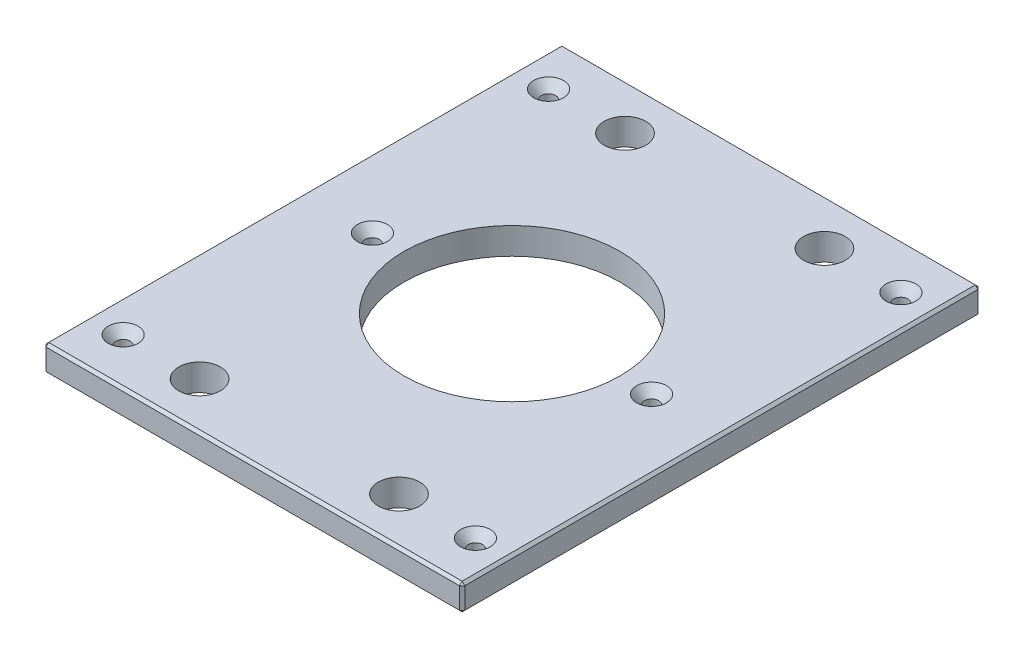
ISO-10303-21;
HEADER;
FILE_DESCRIPTION(('STEP AP214'),'2;1');
FILE_NAME('part.step','',(''),(''),'','','');
FILE_SCHEMA(('AUTOMOTIVE_DESIGN { 1 0 10303 214 1 1 1 1 }'));
ENDSEC;
DATA;
#1=APPLICATION_CONTEXT('core data for automotive mechanical design processes');
#2=APPLICATION_PROTOCOL_DEFINITION('international standard','automotive_design',2000,#1);
#3=PRODUCT_CONTEXT('',#1,'mechanical');
#4=PRODUCT('Part','Part','',(#3));
#5=PRODUCT_RELATED_PRODUCT_CATEGORY('part','',(#4));
#6=PRODUCT_DEFINITION_FORMATION('','',#4);
#7=PRODUCT_DEFINITION_CONTEXT('part definition',#1,'design');
#8=PRODUCT_DEFINITION('design','',#6,#7);
#9=PRODUCT_DEFINITION_SHAPE('','',#8);
#10=(LENGTH_UNIT() NAMED_UNIT(*) SI_UNIT(.MILLI.,.METRE.));
#11=(NAMED_UNIT(*) PLANE_ANGLE_UNIT() SI_UNIT($,.RADIAN.));
#12=(NAMED_UNIT(*) SI_UNIT($,.STERADIAN.) SOLID_ANGLE_UNIT());
#13=UNCERTAINTY_MEASURE_WITH_UNIT(LENGTH_MEASURE(1.E-05),#10,'distance_accuracy_value','');
#14=(GEOMETRIC_REPRESENTATION_CONTEXT(3) GLOBAL_UNCERTAINTY_ASSIGNED_CONTEXT((#13)) GLOBAL_UNIT_ASSIGNED_CONTEXT((#10,
#11,#12)) REPRESENTATION_CONTEXT('',''));
#15=CARTESIAN_POINT('',(0.,0.,0.));
#16=DIRECTION('',(0.,0.,1.));
#17=DIRECTION('',(1.,0.,0.));
#18=AXIS2_PLACEMENT_3D('',#15,#16,#17);
#19=CARTESIAN_POINT('',(-100.0125,12.7,-123.825));
#20=DIRECTION('',(1.,0.,0.));
#21=DIRECTION('',(0.,0.,-1.));
#22=AXIS2_PLACEMENT_3D('',#19,#20,#21);
#23=PLANE('',#22);
#24=DIRECTION('',(0.,0.,-1.));
#25=VECTOR('',#24,1.);
#26=CARTESIAN_POINT('',(-100.0125,11.43,-123.825));
#27=LINE('',#26,#25);
#28=CARTESIAN_POINT('',(-100.0125,11.43,122.555));
#29=VERTEX_POINT('',#28);
#30=CARTESIAN_POINT('',(-100.0125,11.43,-122.555));
#31=VERTEX_POINT('',#30);
#32=EDGE_CURVE('E135',#29,#31,#27,.T.);
#33=ORIENTED_EDGE('',*,*,#32,.T.);
#34=DIRECTION('',(0.,-1.,0.));
#35=VECTOR('',#34,1.);
#36=CARTESIAN_POINT('',(-100.0125,12.7,-122.555));
#37=LINE('',#36,#35);
#38=CARTESIAN_POINT('',(-100.0125,1.26999999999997,-122.555));
#39=VERTEX_POINT('',#38);
#40=EDGE_CURVE('E131',#31,#39,#37,.T.);
#41=ORIENTED_EDGE('',*,*,#40,.T.);
#42=DIRECTION('',(0.,0.,1.));
#43=VECTOR('',#42,1.);
#44=CARTESIAN_POINT('',(-100.0125,1.26999999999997,-123.825));
#45=LINE('',#44,#43);
#46=CARTESIAN_POINT('',(-100.0125,1.26999999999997,122.555));
#47=VERTEX_POINT('',#46);
#48=EDGE_CURVE('E126',#39,#47,#45,.T.);
#49=ORIENTED_EDGE('',*,*,#48,.T.);
#50=DIRECTION('',(0.,1.,0.));
#51=VECTOR('',#50,1.);
#52=CARTESIAN_POINT('',(-100.0125,12.7,122.555));
#53=LINE('',#52,#51);
#54=EDGE_CURVE('E128',#47,#29,#53,.T.);
#55=ORIENTED_EDGE('',*,*,#54,.T.);
#56=EDGE_LOOP('',(#33,#41,#49,#55));
#57=FACE_BOUND('',#56,.T.);
#58=ADVANCED_FACE('F35',(#57),#23,.F.);
#59=CARTESIAN_POINT('',(-100.0125,12.7,123.825));
#60=DIRECTION('',(0.,0.,-1.));
#61=DIRECTION('',(-1.,0.,0.));
#62=AXIS2_PLACEMENT_3D('',#59,#60,#61);
#63=PLANE('',#62);
#64=DIRECTION('',(1.,0.,0.));
#65=VECTOR('',#64,1.);
#66=CARTESIAN_POINT('',(-100.0125,1.26999999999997,123.825));
#67=LINE('',#66,#65);
#68=CARTESIAN_POINT('',(-98.7425000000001,1.26999999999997,123.825));
#69=VERTEX_POINT('',#68);
#70=CARTESIAN_POINT('',(98.7425000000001,1.26999999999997,123.825));
#71=VERTEX_POINT('',#70);
#72=EDGE_CURVE('E58',#69,#71,#67,.T.);
#73=ORIENTED_EDGE('',*,*,#72,.T.);
#74=DIRECTION('',(0.,1.,0.));
#75=VECTOR('',#74,1.);
#76=CARTESIAN_POINT('',(98.7425000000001,12.7,123.825));
#77=LINE('',#76,#75);
#78=CARTESIAN_POINT('',(98.7425000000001,11.43,123.825));
#79=VERTEX_POINT('',#78);
#80=EDGE_CURVE('E11',#71,#79,#77,.T.);
#81=ORIENTED_EDGE('',*,*,#80,.T.);
#82=DIRECTION('',(-1.,0.,0.));
#83=VECTOR('',#82,1.);
#84=CARTESIAN_POINT('',(-100.0125,11.43,123.825));
#85=LINE('',#84,#83);
#86=CARTESIAN_POINT('',(-98.7425000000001,11.43,123.825));
#87=VERTEX_POINT('',#86);
#88=EDGE_CURVE('E44',#79,#87,#85,.T.);
#89=ORIENTED_EDGE('',*,*,#88,.T.);
#90=DIRECTION('',(0.,-1.,0.));
#91=VECTOR('',#90,1.);
#92=CARTESIAN_POINT('',(-98.7425000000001,12.7,123.825));
#93=LINE('',#92,#91);
#94=EDGE_CURVE('E279',#87,#69,#93,.T.);
#95=ORIENTED_EDGE('',*,*,#94,.T.);
#96=EDGE_LOOP('',(#73,#81,#89,#95));
#97=FACE_BOUND('',#96,.T.);
#98=ADVANCED_FACE('F348',(#97),#63,.F.);
#99=CARTESIAN_POINT('',(100.0125,12.7,-123.825));
#100=DIRECTION('',(-1.,0.,0.));
#101=DIRECTION('',(0.,0.,1.));
#102=AXIS2_PLACEMENT_3D('',#99,#100,#101);
#103=PLANE('',#102);
#104=DIRECTION('',(0.,0.,-1.));
#105=VECTOR('',#104,1.);
#106=CARTESIAN_POINT('',(100.0125,1.26999999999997,-123.825));
#107=LINE('',#106,#105);
#108=CARTESIAN_POINT('',(100.0125,1.26999999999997,122.555));
#109=VERTEX_POINT('',#108);
#110=CARTESIAN_POINT('',(100.0125,1.26999999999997,-122.555));
#111=VERTEX_POINT('',#110);
#112=EDGE_CURVE('E274',#109,#111,#107,.T.);
#113=ORIENTED_EDGE('',*,*,#112,.T.);
#114=DIRECTION('',(0.,1.,0.));
#115=VECTOR('',#114,1.);
#116=CARTESIAN_POINT('',(100.0125,12.7,-122.555));
#117=LINE('',#116,#115);
#118=CARTESIAN_POINT('',(100.0125,11.43,-122.555));
#119=VERTEX_POINT('',#118);
#120=EDGE_CURVE('E276',#111,#119,#117,.T.);
#121=ORIENTED_EDGE('',*,*,#120,.T.);
#122=DIRECTION('',(0.,0.,1.));
#123=VECTOR('',#122,1.);
#124=CARTESIAN_POINT('',(100.0125,11.43,123.825));
#125=LINE('',#124,#123);
#126=CARTESIAN_POINT('',(100.0125,11.43,122.555));
#127=VERTEX_POINT('',#126);
#128=EDGE_CURVE('E272',#119,#127,#125,.T.);
#129=ORIENTED_EDGE('',*,*,#128,.T.);
#130=DIRECTION('',(0.,-1.,0.));
#131=VECTOR('',#130,1.);
#132=CARTESIAN_POINT('',(100.0125,12.7,122.555));
#133=LINE('',#132,#131);
#134=EDGE_CURVE('E270',#127,#109,#133,.T.);
#135=ORIENTED_EDGE('',*,*,#134,.T.);
#136=EDGE_LOOP('',(#113,#121,#129,#135));
#137=FACE_BOUND('',#136,.T.);
#138=ADVANCED_FACE('F335',(#137),#103,.F.);
#139=CARTESIAN_POINT('',(-100.0125,12.7,-123.825));
#140=DIRECTION('',(0.,0.,1.));
#141=DIRECTION('',(1.,0.,0.));
#142=AXIS2_PLACEMENT_3D('',#139,#140,#141);
#143=PLANE('',#142);
#144=DIRECTION('',(-1.,0.,0.));
#145=VECTOR('',#144,1.);
#146=CARTESIAN_POINT('',(-100.0125,1.26999999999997,-123.825));
#147=LINE('',#146,#145);
#148=CARTESIAN_POINT('',(98.7425000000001,1.26999999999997,-123.825));
#149=VERTEX_POINT('',#148);
#150=CARTESIAN_POINT('',(-98.7425000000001,1.26999999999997,-123.825));
#151=VERTEX_POINT('',#150);
#152=EDGE_CURVE('E246',#149,#151,#147,.T.);
#153=ORIENTED_EDGE('',*,*,#152,.T.);
#154=DIRECTION('',(0.,1.,0.));
#155=VECTOR('',#154,1.);
#156=CARTESIAN_POINT('',(-98.7425000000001,12.7,-123.825));
#157=LINE('',#156,#155);
#158=CARTESIAN_POINT('',(-98.7425000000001,11.43,-123.825));
#159=VERTEX_POINT('',#158);
#160=EDGE_CURVE('E250',#151,#159,#157,.T.);
#161=ORIENTED_EDGE('',*,*,#160,.T.);
#162=DIRECTION('',(1.,0.,0.));
#163=VECTOR('',#162,1.);
#164=CARTESIAN_POINT('',(100.0125,11.43,-123.825));
#165=LINE('',#164,#163);
#166=CARTESIAN_POINT('',(98.7425000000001,11.43,-123.825));
#167=VERTEX_POINT('',#166);
#168=EDGE_CURVE('E248',#159,#167,#165,.T.);
#169=ORIENTED_EDGE('',*,*,#168,.T.);
#170=DIRECTION('',(0.,-1.,0.));
#171=VECTOR('',#170,1.);
#172=CARTESIAN_POINT('',(98.7425000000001,12.7,-123.825));
#173=LINE('',#172,#171);
#174=EDGE_CURVE('E244',#167,#149,#173,.T.);
#175=ORIENTED_EDGE('',*,*,#174,.T.);
#176=EDGE_LOOP('',(#153,#161,#169,#175));
#177=FACE_BOUND('',#176,.T.);
#178=ADVANCED_FACE('F309',(#177),#143,.F.);
#179=CARTESIAN_POINT('',(0.,12.7,0.));
#180=DIRECTION('',(0.,1.,0.));
#181=DIRECTION('',(0.,0.,1.));
#182=AXIS2_PLACEMENT_3D('',#179,#180,#181);
#183=PLANE('',#182);
#184=CARTESIAN_POINT('',(84.1375,12.7,-101.6));
#185=DIRECTION('',(0.,1.,0.));
#186=DIRECTION('',(0.,0.,1.));
#187=AXIS2_PLACEMENT_3D('',#184,#185,#186);
#188=CIRCLE('',#187,7.1374);
#189=CARTESIAN_POINT('',(84.1375,12.7,-94.4626));
#190=VERTEX_POINT('',#189);
#191=EDGE_CURVE('E752',#190,#190,#188,.T.);
#192=ORIENTED_EDGE('',*,*,#191,.F.);
#193=EDGE_LOOP('',(#192));
#194=FACE_BOUND('',#193,.T.);
#195=CARTESIAN_POINT('',(84.1375,12.7,101.6));
#196=DIRECTION('',(0.,1.,0.));
#197=DIRECTION('',(0.,0.,1.));
#198=AXIS2_PLACEMENT_3D('',#195,#196,#197);
#199=CIRCLE('',#198,7.1374);
#200=CARTESIAN_POINT('',(84.1375,12.7,108.7374));
#201=VERTEX_POINT('',#200);
#202=EDGE_CURVE('E756',#201,#201,#199,.T.);
#203=ORIENTED_EDGE('',*,*,#202,.F.);
#204=EDGE_LOOP('',(#203));
#205=FACE_BOUND('',#204,.T.);
#206=CARTESIAN_POINT('',(-84.1375,12.7,101.6));
#207=DIRECTION('',(0.,1.,0.));
#208=DIRECTION('',(0.,0.,1.));
#209=AXIS2_PLACEMENT_3D('',#206,#207,#208);
#210=CIRCLE('',#209,7.1374);
#211=CARTESIAN_POINT('',(-84.1375,12.7,108.7374));
#212=VERTEX_POINT('',#211);
#213=EDGE_CURVE('E760',#212,#212,#210,.T.);
#214=ORIENTED_EDGE('',*,*,#213,.F.);
#215=EDGE_LOOP('',(#214));
#216=FACE_BOUND('',#215,.T.);
#217=CARTESIAN_POINT('',(-66.675,12.7,0.));
#218=DIRECTION('',(0.,1.,0.));
#219=DIRECTION('',(0.,0.,1.));
#220=AXIS2_PLACEMENT_3D('',#217,#218,#219);
#221=CIRCLE('',#220,7.1374);
#222=CARTESIAN_POINT('',(-66.675,12.7,7.1374));
#223=VERTEX_POINT('',#222);
#224=EDGE_CURVE('E764',#223,#223,#221,.T.);
#225=ORIENTED_EDGE('',*,*,#224,.F.);
#226=EDGE_LOOP('',(#225));
#227=FACE_BOUND('',#226,.T.);
#228=CARTESIAN_POINT('',(66.675,12.7,0.));
#229=DIRECTION('',(0.,1.,0.));
#230=DIRECTION('',(0.,0.,1.));
#231=AXIS2_PLACEMENT_3D('',#228,#229,#230);
#232=CIRCLE('',#231,7.1374);
#233=CARTESIAN_POINT('',(66.675,12.7,7.1374));
#234=VERTEX_POINT('',#233);
#235=EDGE_CURVE('E768',#234,#234,#232,.T.);
#236=ORIENTED_EDGE('',*,*,#235,.F.);
#237=EDGE_LOOP('',(#236));
#238=FACE_BOUND('',#237,.T.);
#239=CARTESIAN_POINT('',(-84.1375,12.7,-101.6));
#240=DIRECTION('',(0.,1.,0.));
#241=DIRECTION('',(0.,0.,1.));
#242=AXIS2_PLACEMENT_3D('',#239,#240,#241);
#243=CIRCLE('',#242,7.1374);
#244=CARTESIAN_POINT('',(-84.1375,12.7,-94.4626));
#245=VERTEX_POINT('',#244);
#246=EDGE_CURVE('E771',#245,#245,#243,.T.);
#247=ORIENTED_EDGE('',*,*,#246,.F.);
#248=EDGE_LOOP('',(#247));
#249=FACE_BOUND('',#248,.T.);
#250=DIRECTION('',(0.,0.,-1.));
#251=VECTOR('',#250,1.);
#252=CARTESIAN_POINT('',(98.7425000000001,12.7,-123.825));
#253=LINE('',#252,#251);
#254=CARTESIAN_POINT('',(98.7425000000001,12.7,122.555));
#255=VERTEX_POINT('',#254);
#256=CARTESIAN_POINT('',(98.7425000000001,12.7,-122.555));
#257=VERTEX_POINT('',#256);
#258=EDGE_CURVE('E257',#255,#257,#253,.T.);
#259=ORIENTED_EDGE('',*,*,#258,.T.);
#260=DIRECTION('',(-1.,0.,0.));
#261=VECTOR('',#260,1.);
#262=CARTESIAN_POINT('',(-100.0125,12.7,-122.555));
#263=LINE('',#262,#261);
#264=CARTESIAN_POINT('',(-98.7425000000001,12.7,-122.555));
#265=VERTEX_POINT('',#264);
#266=EDGE_CURVE('E259',#257,#265,#263,.T.);
#267=ORIENTED_EDGE('',*,*,#266,.T.);
#268=DIRECTION('',(0.,0.,1.));
#269=VECTOR('',#268,1.);
#270=CARTESIAN_POINT('',(-98.7425000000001,12.7,123.825));
#271=LINE('',#270,#269);
#272=CARTESIAN_POINT('',(-98.7425000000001,12.7,122.555));
#273=VERTEX_POINT('',#272);
#274=EDGE_CURVE('E255',#265,#273,#271,.T.);
#275=ORIENTED_EDGE('',*,*,#274,.T.);
#276=DIRECTION('',(1.,0.,0.));
#277=VECTOR('',#276,1.);
#278=CARTESIAN_POINT('',(100.0125,12.7,122.555));
#279=LINE('',#278,#277);
#280=EDGE_CURVE('E253',#273,#255,#279,.T.);
#281=ORIENTED_EDGE('',*,*,#280,.T.);
#282=EDGE_LOOP('',(#259,#267,#275,#281));
#283=FACE_BOUND('',#282,.T.);
#284=CARTESIAN_POINT('',(47.625,12.7,-101.6));
#285=DIRECTION('',(0.,1.,0.));
#286=DIRECTION('',(0.,0.,1.));
#287=AXIS2_PLACEMENT_3D('',#284,#285,#286);
#288=CIRCLE('',#287,9.921875);
#289=CARTESIAN_POINT('',(47.625,12.7,-91.678125));
#290=VERTEX_POINT('',#289);
#291=EDGE_CURVE('E204',#290,#290,#288,.T.);
#292=ORIENTED_EDGE('',*,*,#291,.F.);
#293=EDGE_LOOP('',(#292));
#294=FACE_BOUND('',#293,.T.);
#295=CARTESIAN_POINT('',(-47.625,12.7,-101.6));
#296=DIRECTION('',(0.,1.,0.));
#297=DIRECTION('',(0.,0.,1.));
#298=AXIS2_PLACEMENT_3D('',#295,#296,#297);
#299=CIRCLE('',#298,9.921875);
#300=CARTESIAN_POINT('',(-47.625,12.7,-91.678125));
#301=VERTEX_POINT('',#300);
#302=EDGE_CURVE('E214',#301,#301,#299,.T.);
#303=ORIENTED_EDGE('',*,*,#302,.F.);
#304=EDGE_LOOP('',(#303));
#305=FACE_BOUND('',#304,.T.);
#306=CARTESIAN_POINT('',(47.625,12.7,101.6));
#307=DIRECTION('',(0.,1.,0.));
#308=DIRECTION('',(0.,0.,1.));
#309=AXIS2_PLACEMENT_3D('',#306,#307,#308);
#310=CIRCLE('',#309,9.921875);
#311=CARTESIAN_POINT('',(47.625,12.7,111.521875));
#312=VERTEX_POINT('',#311);
#313=EDGE_CURVE('E225',#312,#312,#310,.T.);
#314=ORIENTED_EDGE('',*,*,#313,.F.);
#315=EDGE_LOOP('',(#314));
#316=FACE_BOUND('',#315,.T.);
#317=CARTESIAN_POINT('',(-47.625,12.7,101.6));
#318=DIRECTION('',(0.,1.,0.));
#319=DIRECTION('',(0.,0.,1.));
#320=AXIS2_PLACEMENT_3D('',#317,#318,#319);
#321=CIRCLE('',#320,9.921875);
#322=CARTESIAN_POINT('',(-47.625,12.7,111.521875));
#323=VERTEX_POINT('',#322);
#324=EDGE_CURVE('E231',#323,#323,#321,.T.);
#325=ORIENTED_EDGE('',*,*,#324,.F.);
#326=EDGE_LOOP('',(#325));
#327=FACE_BOUND('',#326,.T.);
#328=CARTESIAN_POINT('',(0.,12.7,0.));
#329=DIRECTION('',(0.,1.,0.));
#330=DIRECTION('',(0.,0.,1.));
#331=AXIS2_PLACEMENT_3D('',#328,#329,#330);
#332=CIRCLE('',#331,51.562);
#333=CARTESIAN_POINT('',(0.,12.7,51.562));
#334=VERTEX_POINT('',#333);
#335=EDGE_CURVE('E237',#334,#334,#332,.T.);
#336=ORIENTED_EDGE('',*,*,#335,.F.);
#337=EDGE_LOOP('',(#336));
#338=FACE_BOUND('',#337,.T.);
#339=ADVANCED_FACE('F357',(#194,#205,#216,#227,#238,#249,#283,#294,#305,#316,#327,#338),#183,.T.);
#340=CARTESIAN_POINT('',(0.,0.,0.));
#341=DIRECTION('',(0.,1.,0.));
#342=DIRECTION('',(0.,0.,1.));
#343=AXIS2_PLACEMENT_3D('',#340,#341,#342);
#344=PLANE('',#343);
#345=CARTESIAN_POINT('',(84.1375,0.,-101.6));
#346=DIRECTION('',(0.,1.,0.));
#347=DIRECTION('',(0.,0.,1.));
#348=AXIS2_PLACEMENT_3D('',#345,#346,#347);
#349=CIRCLE('',#348,3.3782);
#350=CARTESIAN_POINT('',(84.1375,0.,-98.2218));
#351=VERTEX_POINT('',#350);
#352=EDGE_CURVE('E805',#351,#351,#349,.T.);
#353=ORIENTED_EDGE('',*,*,#352,.T.);
#354=EDGE_LOOP('',(#353));
#355=FACE_BOUND('',#354,.T.);
#356=CARTESIAN_POINT('',(84.1375,0.,101.6));
#357=DIRECTION('',(0.,1.,0.));
#358=DIRECTION('',(0.,0.,1.));
#359=AXIS2_PLACEMENT_3D('',#356,#357,#358);
#360=CIRCLE('',#359,3.3782);
#361=CARTESIAN_POINT('',(84.1375,0.,104.9782));
#362=VERTEX_POINT('',#361);
#363=EDGE_CURVE('E798',#362,#362,#360,.T.);
#364=ORIENTED_EDGE('',*,*,#363,.T.);
#365=EDGE_LOOP('',(#364));
#366=FACE_BOUND('',#365,.T.);
#367=CARTESIAN_POINT('',(-84.1375,0.,101.6));
#368=DIRECTION('',(0.,1.,0.));
#369=DIRECTION('',(0.,0.,1.));
#370=AXIS2_PLACEMENT_3D('',#367,#368,#369);
#371=CIRCLE('',#370,3.3782);
#372=CARTESIAN_POINT('',(-84.1375,0.,104.9782));
#373=VERTEX_POINT('',#372);
#374=EDGE_CURVE('E791',#373,#373,#371,.T.);
#375=ORIENTED_EDGE('',*,*,#374,.T.);
#376=EDGE_LOOP('',(#375));
#377=FACE_BOUND('',#376,.T.);
#378=CARTESIAN_POINT('',(-66.675,0.,0.));
#379=DIRECTION('',(0.,1.,0.));
#380=DIRECTION('',(0.,0.,1.));
#381=AXIS2_PLACEMENT_3D('',#378,#379,#380);
#382=CIRCLE('',#381,3.3782);
#383=CARTESIAN_POINT('',(-66.675,0.,3.3782));
#384=VERTEX_POINT('',#383);
#385=EDGE_CURVE('E784',#384,#384,#382,.T.);
#386=ORIENTED_EDGE('',*,*,#385,.T.);
#387=EDGE_LOOP('',(#386));
#388=FACE_BOUND('',#387,.T.);
#389=CARTESIAN_POINT('',(66.675,0.,0.));
#390=DIRECTION('',(0.,1.,0.));
#391=DIRECTION('',(0.,0.,1.));
#392=AXIS2_PLACEMENT_3D('',#389,#390,#391);
#393=CIRCLE('',#392,3.3782);
#394=CARTESIAN_POINT('',(66.675,0.,3.3782));
#395=VERTEX_POINT('',#394);
#396=EDGE_CURVE('E774',#395,#395,#393,.T.);
#397=ORIENTED_EDGE('',*,*,#396,.T.);
#398=EDGE_LOOP('',(#397));
#399=FACE_BOUND('',#398,.T.);
#400=CARTESIAN_POINT('',(-84.1375,0.,-101.6));
#401=DIRECTION('',(0.,1.,0.));
#402=DIRECTION('',(0.,0.,1.));
#403=AXIS2_PLACEMENT_3D('',#400,#401,#402);
#404=CIRCLE('',#403,3.3782);
#405=CARTESIAN_POINT('',(-84.1375,0.,-98.2218));
#406=VERTEX_POINT('',#405);
#407=EDGE_CURVE('E217',#406,#406,#404,.T.);
#408=ORIENTED_EDGE('',*,*,#407,.T.);
#409=EDGE_LOOP('',(#408));
#410=FACE_BOUND('',#409,.T.);
#411=DIRECTION('',(0.,0.,-1.));
#412=VECTOR('',#411,1.);
#413=CARTESIAN_POINT('',(-98.7425000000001,0.,0.));
#414=LINE('',#413,#412);
#415=CARTESIAN_POINT('',(-98.7425000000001,0.,122.555));
#416=VERTEX_POINT('',#415);
#417=CARTESIAN_POINT('',(-98.7425000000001,0.,-122.555));
#418=VERTEX_POINT('',#417);
#419=EDGE_CURVE('E158',#416,#418,#414,.T.);
#420=ORIENTED_EDGE('',*,*,#419,.T.);
#421=DIRECTION('',(1.,0.,0.));
#422=VECTOR('',#421,1.);
#423=CARTESIAN_POINT('',(0.,0.,-122.555));
#424=LINE('',#423,#422);
#425=CARTESIAN_POINT('',(98.7425000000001,0.,-122.555));
#426=VERTEX_POINT('',#425);
#427=EDGE_CURVE('E267',#418,#426,#424,.T.);
#428=ORIENTED_EDGE('',*,*,#427,.T.);
#429=DIRECTION('',(0.,0.,1.));
#430=VECTOR('',#429,1.);
#431=CARTESIAN_POINT('',(98.7425000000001,0.,0.));
#432=LINE('',#431,#430);
#433=CARTESIAN_POINT('',(98.7425000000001,0.,122.555));
#434=VERTEX_POINT('',#433);
#435=EDGE_CURVE('E265',#426,#434,#432,.T.);
#436=ORIENTED_EDGE('',*,*,#435,.T.);
#437=DIRECTION('',(-1.,0.,0.));
#438=VECTOR('',#437,1.);
#439=CARTESIAN_POINT('',(0.,0.,122.555));
#440=LINE('',#439,#438);
#441=EDGE_CURVE('E262',#434,#416,#440,.T.);
#442=ORIENTED_EDGE('',*,*,#441,.T.);
#443=EDGE_LOOP('',(#420,#428,#436,#442));
#444=FACE_BOUND('',#443,.T.);
#445=CARTESIAN_POINT('',(47.625,0.,-101.6));
#446=DIRECTION('',(0.,1.,0.));
#447=DIRECTION('',(0.,0.,1.));
#448=AXIS2_PLACEMENT_3D('',#445,#446,#447);
#449=CIRCLE('',#448,9.921875);
#450=CARTESIAN_POINT('',(47.625,0.,-91.678125));
#451=VERTEX_POINT('',#450);
#452=EDGE_CURVE('E209',#451,#451,#449,.T.);
#453=ORIENTED_EDGE('',*,*,#452,.T.);
#454=EDGE_LOOP('',(#453));
#455=FACE_BOUND('',#454,.T.);
#456=CARTESIAN_POINT('',(-47.625,0.,-101.6));
#457=DIRECTION('',(0.,1.,0.));
#458=DIRECTION('',(0.,0.,1.));
#459=AXIS2_PLACEMENT_3D('',#456,#457,#458);
#460=CIRCLE('',#459,9.921875);
#461=CARTESIAN_POINT('',(-47.625,0.,-91.678125));
#462=VERTEX_POINT('',#461);
#463=EDGE_CURVE('E222',#462,#462,#460,.T.);
#464=ORIENTED_EDGE('',*,*,#463,.T.);
#465=EDGE_LOOP('',(#464));
#466=FACE_BOUND('',#465,.T.);
#467=CARTESIAN_POINT('',(47.625,0.,101.6));
#468=DIRECTION('',(0.,1.,0.));
#469=DIRECTION('',(0.,0.,1.));
#470=AXIS2_PLACEMENT_3D('',#467,#468,#469);
#471=CIRCLE('',#470,9.921875);
#472=CARTESIAN_POINT('',(47.625,0.,111.521875));
#473=VERTEX_POINT('',#472);
#474=EDGE_CURVE('E228',#473,#473,#471,.T.);
#475=ORIENTED_EDGE('',*,*,#474,.T.);
#476=EDGE_LOOP('',(#475));
#477=FACE_BOUND('',#476,.T.);
#478=CARTESIAN_POINT('',(-47.625,0.,101.6));
#479=DIRECTION('',(0.,1.,0.));
#480=DIRECTION('',(0.,0.,1.));
#481=AXIS2_PLACEMENT_3D('',#478,#479,#480);
#482=CIRCLE('',#481,9.921875);
#483=CARTESIAN_POINT('',(-47.625,0.,111.521875));
#484=VERTEX_POINT('',#483);
#485=EDGE_CURVE('E234',#484,#484,#482,.T.);
#486=ORIENTED_EDGE('',*,*,#485,.T.);
#487=EDGE_LOOP('',(#486));
#488=FACE_BOUND('',#487,.T.);
#489=CARTESIAN_POINT('',(0.,0.,0.));
#490=DIRECTION('',(0.,1.,0.));
#491=DIRECTION('',(0.,0.,1.));
#492=AXIS2_PLACEMENT_3D('',#489,#490,#491);
#493=CIRCLE('',#492,51.562);
#494=CARTESIAN_POINT('',(0.,0.,51.562));
#495=VERTEX_POINT('',#494);
#496=EDGE_CURVE('E147',#495,#495,#493,.T.);
#497=ORIENTED_EDGE('',*,*,#496,.T.);
#498=EDGE_LOOP('',(#497));
#499=FACE_BOUND('',#498,.T.);
#500=ADVANCED_FACE('F322',(#355,#366,#377,#388,#399,#410,#444,#455,#466,#477,#488,#499),#344,.F.);
#501=CARTESIAN_POINT('',(0.,0.,0.));
#502=DIRECTION('',(0.,1.,0.));
#503=DIRECTION('',(0.,0.,1.));
#504=AXIS2_PLACEMENT_3D('',#501,#502,#503);
#505=CYLINDRICAL_SURFACE('',#504,51.562);
#506=ORIENTED_EDGE('',*,*,#496,.F.);
#507=EDGE_LOOP('',(#506));
#508=FACE_BOUND('',#507,.T.);
#509=ORIENTED_EDGE('',*,*,#335,.T.);
#510=EDGE_LOOP('',(#509));
#511=FACE_BOUND('',#510,.T.);
#512=ADVANCED_FACE('F691',(#508,#511),#505,.F.);
#513=CARTESIAN_POINT('',(-47.625,12.7,101.6));
#514=DIRECTION('',(0.,1.,0.));
#515=DIRECTION('',(0.,0.,1.));
#516=AXIS2_PLACEMENT_3D('',#513,#514,#515);
#517=CYLINDRICAL_SURFACE('',#516,9.921875);
#518=ORIENTED_EDGE('',*,*,#485,.F.);
#519=EDGE_LOOP('',(#518));
#520=FACE_BOUND('',#519,.T.);
#521=ORIENTED_EDGE('',*,*,#324,.T.);
#522=EDGE_LOOP('',(#521));
#523=FACE_BOUND('',#522,.T.);
#524=ADVANCED_FACE('F682',(#520,#523),#517,.F.);
#525=CARTESIAN_POINT('',(47.625,12.7,101.6));
#526=DIRECTION('',(0.,1.,0.));
#527=DIRECTION('',(0.,0.,1.));
#528=AXIS2_PLACEMENT_3D('',#525,#526,#527);
#529=CYLINDRICAL_SURFACE('',#528,9.921875);
#530=ORIENTED_EDGE('',*,*,#474,.F.);
#531=EDGE_LOOP('',(#530));
#532=FACE_BOUND('',#531,.T.);
#533=ORIENTED_EDGE('',*,*,#313,.T.);
#534=EDGE_LOOP('',(#533));
#535=FACE_BOUND('',#534,.T.);
#536=ADVANCED_FACE('F673',(#532,#535),#529,.F.);
#537=CARTESIAN_POINT('',(-47.625,12.7,-101.6));
#538=DIRECTION('',(0.,1.,0.));
#539=DIRECTION('',(0.,0.,1.));
#540=AXIS2_PLACEMENT_3D('',#537,#538,#539);
#541=CYLINDRICAL_SURFACE('',#540,9.921875);
#542=ORIENTED_EDGE('',*,*,#463,.F.);
#543=EDGE_LOOP('',(#542));
#544=FACE_BOUND('',#543,.T.);
#545=ORIENTED_EDGE('',*,*,#302,.T.);
#546=EDGE_LOOP('',(#545));
#547=FACE_BOUND('',#546,.T.);
#548=ADVANCED_FACE('F663',(#544,#547),#541,.F.);
#549=CARTESIAN_POINT('',(47.625,12.7,-101.6));
#550=DIRECTION('',(0.,1.,0.));
#551=DIRECTION('',(0.,0.,1.));
#552=AXIS2_PLACEMENT_3D('',#549,#550,#551);
#553=CYLINDRICAL_SURFACE('',#552,9.921875);
#554=ORIENTED_EDGE('',*,*,#452,.F.);
#555=EDGE_LOOP('',(#554));
#556=FACE_BOUND('',#555,.T.);
#557=ORIENTED_EDGE('',*,*,#291,.T.);
#558=EDGE_LOOP('',(#557));
#559=FACE_BOUND('',#558,.T.);
#560=ADVANCED_FACE('F366',(#556,#559),#553,.F.);
#561=CARTESIAN_POINT('',(100.0125,12.7,122.555));
#562=DIRECTION('',(-0.707106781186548,0.,-0.707106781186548));
#563=DIRECTION('',(0.,-1.,0.));
#564=AXIS2_PLACEMENT_3D('',#561,#562,#563);
#565=PLANE('',#564);
#566=DIRECTION('',(-0.707106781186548,0.,0.707106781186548));
#567=VECTOR('',#566,1.);
#568=CARTESIAN_POINT('',(100.0125,11.43,122.555));
#569=LINE('',#568,#567);
#570=EDGE_CURVE('E39',#79,#127,#569,.F.);
#571=ORIENTED_EDGE('',*,*,#570,.F.);
#572=ORIENTED_EDGE('',*,*,#80,.F.);
#573=DIRECTION('',(0.707106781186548,0.,-0.707106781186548));
#574=VECTOR('',#573,1.);
#575=CARTESIAN_POINT('',(99.3775000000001,1.26999999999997,123.19));
#576=LINE('',#575,#574);
#577=EDGE_CURVE('E197',#109,#71,#576,.F.);
#578=ORIENTED_EDGE('',*,*,#577,.F.);
#579=ORIENTED_EDGE('',*,*,#134,.F.);
#580=EDGE_LOOP('',(#571,#572,#578,#579));
#581=FACE_BOUND('',#580,.T.);
#582=ADVANCED_FACE('F37',(#581),#565,.F.);
#583=CARTESIAN_POINT('',(100.0125,11.43,122.555));
#584=DIRECTION('',(0.577350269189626,0.577350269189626,0.577350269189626));
#585=DIRECTION('',(0.707106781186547,0.,-0.707106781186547));
#586=AXIS2_PLACEMENT_3D('',#583,#584,#585);
#587=PLANE('',#586);
#588=DIRECTION('',(0.,-0.707106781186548,0.707106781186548));
#589=VECTOR('',#588,1.);
#590=CARTESIAN_POINT('',(98.7425000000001,12.065,123.19));
#591=LINE('',#590,#589);
#592=EDGE_CURVE('E193',#79,#255,#591,.F.);
#593=ORIENTED_EDGE('',*,*,#592,.F.);
#594=ORIENTED_EDGE('',*,*,#570,.T.);
#595=DIRECTION('',(-0.707106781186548,0.707106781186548,0.));
#596=VECTOR('',#595,1.);
#597=CARTESIAN_POINT('',(100.0125,11.43,122.555));
#598=LINE('',#597,#596);
#599=EDGE_CURVE('E195',#255,#127,#598,.F.);
#600=ORIENTED_EDGE('',*,*,#599,.F.);
#601=EDGE_LOOP('',(#593,#594,#600));
#602=FACE_BOUND('',#601,.T.);
#603=ADVANCED_FACE('F359',(#602),#587,.T.);
#604=CARTESIAN_POINT('',(98.7425000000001,0.,122.555));
#605=DIRECTION('',(0.577350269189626,-0.577350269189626,0.577350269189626));
#606=DIRECTION('',(0.707106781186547,0.,-0.707106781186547));
#607=AXIS2_PLACEMENT_3D('',#604,#605,#606);
#608=PLANE('',#607);
#609=DIRECTION('',(-0.707106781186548,-0.707106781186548,0.));
#610=VECTOR('',#609,1.);
#611=CARTESIAN_POINT('',(98.7425000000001,0.,122.555));
#612=LINE('',#611,#610);
#613=EDGE_CURVE('E187',#109,#434,#612,.T.);
#614=ORIENTED_EDGE('',*,*,#613,.F.);
#615=ORIENTED_EDGE('',*,*,#577,.T.);
#616=DIRECTION('',(0.,0.707106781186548,0.707106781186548));
#617=VECTOR('',#616,1.);
#618=CARTESIAN_POINT('',(98.7425000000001,0.,122.555));
#619=LINE('',#618,#617);
#620=EDGE_CURVE('E190',#434,#71,#619,.T.);
#621=ORIENTED_EDGE('',*,*,#620,.F.);
#622=EDGE_LOOP('',(#614,#615,#621));
#623=FACE_BOUND('',#622,.T.);
#624=ADVANCED_FACE('F328',(#623),#608,.T.);
#625=CARTESIAN_POINT('',(98.7425000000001,12.7,0.));
#626=DIRECTION('',(0.707106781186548,0.707106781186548,0.));
#627=DIRECTION('',(0.,0.,1.));
#628=AXIS2_PLACEMENT_3D('',#625,#626,#627);
#629=PLANE('',#628);
#630=ORIENTED_EDGE('',*,*,#599,.T.);
#631=ORIENTED_EDGE('',*,*,#128,.F.);
#632=DIRECTION('',(0.707106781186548,-0.707106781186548,0.));
#633=VECTOR('',#632,1.);
#634=CARTESIAN_POINT('',(99.3775000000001,12.065,-122.555));
#635=LINE('',#634,#633);
#636=EDGE_CURVE('E182',#257,#119,#635,.T.);
#637=ORIENTED_EDGE('',*,*,#636,.F.);
#638=ORIENTED_EDGE('',*,*,#258,.F.);
#639=EDGE_LOOP('',(#630,#631,#637,#638));
#640=FACE_BOUND('',#639,.T.);
#641=ADVANCED_FACE('F345',(#640),#629,.T.);
#642=CARTESIAN_POINT('',(0.,12.7,122.555));
#643=DIRECTION('',(0.,0.707106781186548,0.707106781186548));
#644=DIRECTION('',(-1.,0.,0.));
#645=AXIS2_PLACEMENT_3D('',#642,#643,#644);
#646=PLANE('',#645);
#647=ORIENTED_EDGE('',*,*,#592,.T.);
#648=ORIENTED_EDGE('',*,*,#280,.F.);
#649=DIRECTION('',(0.,0.707106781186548,-0.707106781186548));
#650=VECTOR('',#649,1.);
#651=CARTESIAN_POINT('',(-98.7425000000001,12.7,122.555));
#652=LINE('',#651,#650);
#653=EDGE_CURVE('E179',#87,#273,#652,.T.);
#654=ORIENTED_EDGE('',*,*,#653,.F.);
#655=ORIENTED_EDGE('',*,*,#88,.F.);
#656=EDGE_LOOP('',(#647,#648,#654,#655));
#657=FACE_BOUND('',#656,.T.);
#658=ADVANCED_FACE('F350',(#657),#646,.T.);
#659=CARTESIAN_POINT('',(-98.7425000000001,12.7,123.825));
#660=DIRECTION('',(0.707106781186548,0.,-0.707106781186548));
#661=DIRECTION('',(0.,-1.,0.));
#662=AXIS2_PLACEMENT_3D('',#659,#660,#661);
#663=PLANE('',#662);
#664=DIRECTION('',(0.707106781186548,0.,0.707106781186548));
#665=VECTOR('',#664,1.);
#666=CARTESIAN_POINT('',(-100.0125,1.26999999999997,122.555));
#667=LINE('',#666,#665);
#668=EDGE_CURVE('E142',#69,#47,#667,.F.);
#669=ORIENTED_EDGE('',*,*,#668,.F.);
#670=ORIENTED_EDGE('',*,*,#94,.F.);
#671=DIRECTION('',(-0.707106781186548,0.,-0.707106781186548));
#672=VECTOR('',#671,1.);
#673=CARTESIAN_POINT('',(-99.3775000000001,11.43,123.19));
#674=LINE('',#673,#672);
#675=EDGE_CURVE('E145',#29,#87,#674,.F.);
#676=ORIENTED_EDGE('',*,*,#675,.F.);
#677=ORIENTED_EDGE('',*,*,#54,.F.);
#678=EDGE_LOOP('',(#669,#670,#676,#677));
#679=FACE_BOUND('',#678,.T.);
#680=ADVANCED_FACE('F140',(#679),#663,.F.);
#681=CARTESIAN_POINT('',(-100.0125,1.26999999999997,123.825));
#682=DIRECTION('',(0.,0.707106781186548,-0.707106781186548));
#683=DIRECTION('',(1.,0.,0.));
#684=AXIS2_PLACEMENT_3D('',#681,#682,#683);
#685=PLANE('',#684);
#686=ORIENTED_EDGE('',*,*,#620,.T.);
#687=ORIENTED_EDGE('',*,*,#72,.F.);
#688=DIRECTION('',(0.,-0.707106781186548,-0.707106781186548));
#689=VECTOR('',#688,1.);
#690=CARTESIAN_POINT('',(-98.7425000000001,0.634999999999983,123.19));
#691=LINE('',#690,#689);
#692=EDGE_CURVE('E155',#416,#69,#691,.F.);
#693=ORIENTED_EDGE('',*,*,#692,.F.);
#694=ORIENTED_EDGE('',*,*,#441,.F.);
#695=EDGE_LOOP('',(#686,#687,#693,#694));
#696=FACE_BOUND('',#695,.T.);
#697=ADVANCED_FACE('F327',(#696),#685,.F.);
#698=CARTESIAN_POINT('',(100.0125,1.26999999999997,-123.825));
#699=DIRECTION('',(-0.707106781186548,0.707106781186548,0.));
#700=DIRECTION('',(0.,0.,-1.));
#701=AXIS2_PLACEMENT_3D('',#698,#699,#700);
#702=PLANE('',#701);
#703=ORIENTED_EDGE('',*,*,#613,.T.);
#704=ORIENTED_EDGE('',*,*,#435,.F.);
#705=DIRECTION('',(0.707106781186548,0.707106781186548,0.));
#706=VECTOR('',#705,1.);
#707=CARTESIAN_POINT('',(98.7425000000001,0.,-122.555));
#708=LINE('',#707,#706);
#709=EDGE_CURVE('E174',#111,#426,#708,.F.);
#710=ORIENTED_EDGE('',*,*,#709,.F.);
#711=ORIENTED_EDGE('',*,*,#112,.F.);
#712=EDGE_LOOP('',(#703,#704,#710,#711));
#713=FACE_BOUND('',#712,.T.);
#714=ADVANCED_FACE('F332',(#713),#702,.F.);
#715=CARTESIAN_POINT('',(98.7425000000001,12.7,-123.825));
#716=DIRECTION('',(-0.707106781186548,0.,0.707106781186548));
#717=DIRECTION('',(0.,-1.,0.));
#718=AXIS2_PLACEMENT_3D('',#715,#716,#717);
#719=PLANE('',#718);
#720=DIRECTION('',(0.707106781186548,0.,0.707106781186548));
#721=VECTOR('',#720,1.);
#722=CARTESIAN_POINT('',(98.7425000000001,11.43,-123.825));
#723=LINE('',#722,#721);
#724=EDGE_CURVE('E184',#119,#167,#723,.F.);
#725=ORIENTED_EDGE('',*,*,#724,.F.);
#726=ORIENTED_EDGE('',*,*,#120,.F.);
#727=DIRECTION('',(-0.707106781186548,0.,-0.707106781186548));
#728=VECTOR('',#727,1.);
#729=CARTESIAN_POINT('',(99.3775000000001,1.26999999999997,-123.19));
#730=LINE('',#729,#728);
#731=EDGE_CURVE('E171',#149,#111,#730,.F.);
#732=ORIENTED_EDGE('',*,*,#731,.F.);
#733=ORIENTED_EDGE('',*,*,#174,.F.);
#734=EDGE_LOOP('',(#725,#726,#732,#733));
#735=FACE_BOUND('',#734,.T.);
#736=ADVANCED_FACE('F340',(#735),#719,.F.);
#737=CARTESIAN_POINT('',(98.7425000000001,11.43,-123.825));
#738=DIRECTION('',(0.577350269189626,0.577350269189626,-0.577350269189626));
#739=DIRECTION('',(-0.707106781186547,0.,-0.707106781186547));
#740=AXIS2_PLACEMENT_3D('',#737,#738,#739);
#741=PLANE('',#740);
#742=ORIENTED_EDGE('',*,*,#636,.T.);
#743=ORIENTED_EDGE('',*,*,#724,.T.);
#744=DIRECTION('',(0.,0.707106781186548,0.707106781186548));
#745=VECTOR('',#744,1.);
#746=CARTESIAN_POINT('',(98.7425000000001,11.43,-123.825));
#747=LINE('',#746,#745);
#748=EDGE_CURVE('E163',#257,#167,#747,.F.);
#749=ORIENTED_EDGE('',*,*,#748,.F.);
#750=EDGE_LOOP('',(#742,#743,#749));
#751=FACE_BOUND('',#750,.T.);
#752=ADVANCED_FACE('F398',(#751),#741,.T.);
#753=CARTESIAN_POINT('',(-98.7425000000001,12.7,122.555));
#754=DIRECTION('',(-0.577350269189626,0.577350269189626,0.577350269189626));
#755=DIRECTION('',(0.707106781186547,0.,0.707106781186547));
#756=AXIS2_PLACEMENT_3D('',#753,#754,#755);
#757=PLANE('',#756);
#758=ORIENTED_EDGE('',*,*,#675,.T.);
#759=ORIENTED_EDGE('',*,*,#653,.T.);
#760=DIRECTION('',(-0.707106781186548,-0.707106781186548,0.));
#761=VECTOR('',#760,1.);
#762=CARTESIAN_POINT('',(-98.7425000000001,12.7,122.555));
#763=LINE('',#762,#761);
#764=EDGE_CURVE('E159',#29,#273,#763,.F.);
#765=ORIENTED_EDGE('',*,*,#764,.F.);
#766=EDGE_LOOP('',(#758,#759,#765));
#767=FACE_BOUND('',#766,.T.);
#768=ADVANCED_FACE('F352',(#767),#757,.T.);
#769=CARTESIAN_POINT('',(-100.0125,1.26999999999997,122.555));
#770=DIRECTION('',(-0.577350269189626,-0.577350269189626,0.577350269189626));
#771=DIRECTION('',(0.707106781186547,0.,0.707106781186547));
#772=AXIS2_PLACEMENT_3D('',#769,#770,#771);
#773=PLANE('',#772);
#774=ORIENTED_EDGE('',*,*,#692,.T.);
#775=ORIENTED_EDGE('',*,*,#668,.T.);
#776=DIRECTION('',(-0.707106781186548,0.707106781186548,0.));
#777=VECTOR('',#776,1.);
#778=CARTESIAN_POINT('',(-100.0125,1.26999999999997,122.555));
#779=LINE('',#778,#777);
#780=EDGE_CURVE('E152',#416,#47,#779,.T.);
#781=ORIENTED_EDGE('',*,*,#780,.F.);
#782=EDGE_LOOP('',(#774,#775,#781));
#783=FACE_BOUND('',#782,.T.);
#784=ADVANCED_FACE('F151',(#783),#773,.T.);
#785=CARTESIAN_POINT('',(98.7425000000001,0.,-122.555));
#786=DIRECTION('',(0.577350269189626,-0.577350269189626,-0.577350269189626));
#787=DIRECTION('',(-0.707106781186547,0.,-0.707106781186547));
#788=AXIS2_PLACEMENT_3D('',#785,#786,#787);
#789=PLANE('',#788);
#790=ORIENTED_EDGE('',*,*,#731,.T.);
#791=ORIENTED_EDGE('',*,*,#709,.T.);
#792=DIRECTION('',(0.,-0.707106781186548,0.707106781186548));
#793=VECTOR('',#792,1.);
#794=CARTESIAN_POINT('',(98.7425000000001,0.,-122.555));
#795=LINE('',#794,#793);
#796=EDGE_CURVE('E160',#149,#426,#795,.T.);
#797=ORIENTED_EDGE('',*,*,#796,.F.);
#798=EDGE_LOOP('',(#790,#791,#797));
#799=FACE_BOUND('',#798,.T.);
#800=ADVANCED_FACE('F390',(#799),#789,.T.);
#801=CARTESIAN_POINT('',(0.,12.7,-122.555));
#802=DIRECTION('',(0.,0.707106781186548,-0.707106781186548));
#803=DIRECTION('',(1.,0.,0.));
#804=AXIS2_PLACEMENT_3D('',#801,#802,#803);
#805=PLANE('',#804);
#806=ORIENTED_EDGE('',*,*,#748,.T.);
#807=ORIENTED_EDGE('',*,*,#168,.F.);
#808=DIRECTION('',(0.,-0.707106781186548,-0.707106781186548));
#809=VECTOR('',#808,1.);
#810=CARTESIAN_POINT('',(-98.7425000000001,11.43,-123.825));
#811=LINE('',#810,#809);
#812=EDGE_CURVE('E165',#265,#159,#811,.T.);
#813=ORIENTED_EDGE('',*,*,#812,.F.);
#814=ORIENTED_EDGE('',*,*,#266,.F.);
#815=EDGE_LOOP('',(#806,#807,#813,#814));
#816=FACE_BOUND('',#815,.T.);
#817=ADVANCED_FACE('F304',(#816),#805,.T.);
#818=CARTESIAN_POINT('',(-98.7425000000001,12.7,0.));
#819=DIRECTION('',(-0.707106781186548,0.707106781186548,0.));
#820=DIRECTION('',(0.,0.,-1.));
#821=AXIS2_PLACEMENT_3D('',#818,#819,#820);
#822=PLANE('',#821);
#823=ORIENTED_EDGE('',*,*,#764,.T.);
#824=ORIENTED_EDGE('',*,*,#274,.F.);
#825=DIRECTION('',(0.707106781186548,0.707106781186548,0.));
#826=VECTOR('',#825,1.);
#827=CARTESIAN_POINT('',(-99.3775000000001,12.065,-122.555));
#828=LINE('',#827,#826);
#829=EDGE_CURVE('E293',#31,#265,#828,.T.);
#830=ORIENTED_EDGE('',*,*,#829,.F.);
#831=ORIENTED_EDGE('',*,*,#32,.F.);
#832=EDGE_LOOP('',(#823,#824,#830,#831));
#833=FACE_BOUND('',#832,.T.);
#834=ADVANCED_FACE('F355',(#833),#822,.T.);
#835=CARTESIAN_POINT('',(-100.0125,1.26999999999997,-123.825));
#836=DIRECTION('',(0.707106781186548,0.707106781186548,0.));
#837=DIRECTION('',(0.,0.,1.));
#838=AXIS2_PLACEMENT_3D('',#835,#836,#837);
#839=PLANE('',#838);
#840=ORIENTED_EDGE('',*,*,#780,.T.);
#841=ORIENTED_EDGE('',*,*,#48,.F.);
#842=DIRECTION('',(0.707106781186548,-0.707106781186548,0.));
#843=VECTOR('',#842,1.);
#844=CARTESIAN_POINT('',(-100.0125,1.26999999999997,-122.555));
#845=LINE('',#844,#843);
#846=EDGE_CURVE('E290',#418,#39,#845,.F.);
#847=ORIENTED_EDGE('',*,*,#846,.F.);
#848=ORIENTED_EDGE('',*,*,#419,.F.);
#849=EDGE_LOOP('',(#840,#841,#847,#848));
#850=FACE_BOUND('',#849,.T.);
#851=ADVANCED_FACE('F157',(#850),#839,.F.);
#852=CARTESIAN_POINT('',(-100.0125,1.26999999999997,-123.825));
#853=DIRECTION('',(0.,0.707106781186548,0.707106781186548));
#854=DIRECTION('',(-1.,0.,0.));
#855=AXIS2_PLACEMENT_3D('',#852,#853,#854);
#856=PLANE('',#855);
#857=ORIENTED_EDGE('',*,*,#796,.T.);
#858=ORIENTED_EDGE('',*,*,#427,.F.);
#859=DIRECTION('',(0.,0.707106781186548,-0.707106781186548));
#860=VECTOR('',#859,1.);
#861=CARTESIAN_POINT('',(-98.7425000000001,0.634999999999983,-123.19));
#862=LINE('',#861,#860);
#863=EDGE_CURVE('E287',#151,#418,#862,.F.);
#864=ORIENTED_EDGE('',*,*,#863,.F.);
#865=ORIENTED_EDGE('',*,*,#152,.F.);
#866=EDGE_LOOP('',(#857,#858,#864,#865));
#867=FACE_BOUND('',#866,.T.);
#868=ADVANCED_FACE('F319',(#867),#856,.F.);
#869=CARTESIAN_POINT('',(-98.7425000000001,11.43,-123.825));
#870=DIRECTION('',(-0.577350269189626,0.577350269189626,-0.577350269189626));
#871=DIRECTION('',(-0.707106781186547,0.,0.707106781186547));
#872=AXIS2_PLACEMENT_3D('',#869,#870,#871);
#873=PLANE('',#872);
#874=ORIENTED_EDGE('',*,*,#829,.T.);
#875=ORIENTED_EDGE('',*,*,#812,.T.);
#876=DIRECTION('',(0.707106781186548,0.,-0.707106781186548));
#877=VECTOR('',#876,1.);
#878=CARTESIAN_POINT('',(-98.7425000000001,11.43,-123.825));
#879=LINE('',#878,#877);
#880=EDGE_CURVE('E285',#31,#159,#879,.T.);
#881=ORIENTED_EDGE('',*,*,#880,.F.);
#882=EDGE_LOOP('',(#874,#875,#881));
#883=FACE_BOUND('',#882,.T.);
#884=ADVANCED_FACE('F299',(#883),#873,.T.);
#885=CARTESIAN_POINT('',(-100.0125,1.26999999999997,-122.555));
#886=DIRECTION('',(-0.577350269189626,-0.577350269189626,-0.577350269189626));
#887=DIRECTION('',(-0.707106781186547,0.,0.707106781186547));
#888=AXIS2_PLACEMENT_3D('',#885,#886,#887);
#889=PLANE('',#888);
#890=ORIENTED_EDGE('',*,*,#863,.T.);
#891=ORIENTED_EDGE('',*,*,#846,.T.);
#892=DIRECTION('',(-0.707106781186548,0.,0.707106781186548));
#893=VECTOR('',#892,1.);
#894=CARTESIAN_POINT('',(-100.0125,1.26999999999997,-122.555));
#895=LINE('',#894,#893);
#896=EDGE_CURVE('E283',#151,#39,#895,.T.);
#897=ORIENTED_EDGE('',*,*,#896,.F.);
#898=EDGE_LOOP('',(#890,#891,#897));
#899=FACE_BOUND('',#898,.T.);
#900=ADVANCED_FACE('F316',(#899),#889,.T.);
#901=CARTESIAN_POINT('',(-100.0125,12.7,-122.555));
#902=DIRECTION('',(0.707106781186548,0.,0.707106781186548));
#903=DIRECTION('',(0.,-1.,0.));
#904=AXIS2_PLACEMENT_3D('',#901,#902,#903);
#905=PLANE('',#904);
#906=ORIENTED_EDGE('',*,*,#880,.T.);
#907=ORIENTED_EDGE('',*,*,#160,.F.);
#908=ORIENTED_EDGE('',*,*,#896,.T.);
#909=ORIENTED_EDGE('',*,*,#40,.F.);
#910=EDGE_LOOP('',(#906,#907,#908,#909));
#911=FACE_BOUND('',#910,.T.);
#912=ADVANCED_FACE('F314',(#911),#905,.F.);
#913=CARTESIAN_POINT('',(-84.1375,12.7,-101.6));
#914=DIRECTION('',(0.,1.,0.));
#915=DIRECTION('',(0.,0.,1.));
#916=AXIS2_PLACEMENT_3D('',#913,#914,#915);
#917=CYLINDRICAL_SURFACE('',#916,3.3782);
#918=ORIENTED_EDGE('',*,*,#407,.F.);
#919=EDGE_LOOP('',(#918));
#920=FACE_BOUND('',#919,.T.);
#921=CARTESIAN_POINT('',(-84.1375,8.37553508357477,-101.6));
#922=DIRECTION('',(0.,1.,0.));
#923=DIRECTION('',(0.,0.,1.));
#924=AXIS2_PLACEMENT_3D('',#921,#922,#923);
#925=CIRCLE('',#924,3.3782);
#926=CARTESIAN_POINT('',(-84.1375,8.37553508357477,-98.2218));
#927=VERTEX_POINT('',#926);
#928=EDGE_CURVE('E773',#927,#927,#925,.T.);
#929=ORIENTED_EDGE('',*,*,#928,.T.);
#930=EDGE_LOOP('',(#929));
#931=FACE_BOUND('',#930,.T.);
#932=ADVANCED_FACE('F377',(#920,#931),#917,.F.);
#933=CARTESIAN_POINT('',(-84.1375,12.7,-101.6));
#934=DIRECTION('',(0.,1.,0.));
#935=DIRECTION('',(0.,0.,1.));
#936=AXIS2_PLACEMENT_3D('',#933,#934,#935);
#937=CONICAL_SURFACE('',#936,7.1374,0.715584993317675);
#938=ORIENTED_EDGE('',*,*,#928,.F.);
#939=EDGE_LOOP('',(#938));
#940=FACE_BOUND('',#939,.T.);
#941=ORIENTED_EDGE('',*,*,#246,.T.);
#942=EDGE_LOOP('',(#941));
#943=FACE_BOUND('',#942,.T.);
#944=ADVANCED_FACE('F487',(#940,#943),#937,.F.);
#945=CARTESIAN_POINT('',(66.675,12.7,0.));
#946=DIRECTION('',(0.,1.,0.));
#947=DIRECTION('',(0.,0.,1.));
#948=AXIS2_PLACEMENT_3D('',#945,#946,#947);
#949=CYLINDRICAL_SURFACE('',#948,3.3782);
#950=ORIENTED_EDGE('',*,*,#396,.F.);
#951=EDGE_LOOP('',(#950));
#952=FACE_BOUND('',#951,.T.);
#953=CARTESIAN_POINT('',(66.675,8.37553508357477,0.));
#954=DIRECTION('',(0.,1.,0.));
#955=DIRECTION('',(0.,0.,1.));
#956=AXIS2_PLACEMENT_3D('',#953,#954,#955);
#957=CIRCLE('',#956,3.3782);
#958=CARTESIAN_POINT('',(66.675,8.37553508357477,3.3782));
#959=VERTEX_POINT('',#958);
#960=EDGE_CURVE('E778',#959,#959,#957,.T.);
#961=ORIENTED_EDGE('',*,*,#960,.T.);
#962=EDGE_LOOP('',(#961));
#963=FACE_BOUND('',#962,.T.);
#964=ADVANCED_FACE('F496',(#952,#963),#949,.F.);
#965=CARTESIAN_POINT('',(66.675,12.7,0.));
#966=DIRECTION('',(0.,1.,0.));
#967=DIRECTION('',(0.,0.,1.));
#968=AXIS2_PLACEMENT_3D('',#965,#966,#967);
#969=CONICAL_SURFACE('',#968,7.1374,0.715584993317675);
#970=ORIENTED_EDGE('',*,*,#960,.F.);
#971=EDGE_LOOP('',(#970));
#972=FACE_BOUND('',#971,.T.);
#973=ORIENTED_EDGE('',*,*,#235,.T.);
#974=EDGE_LOOP('',(#973));
#975=FACE_BOUND('',#974,.T.);
#976=ADVANCED_FACE('F504',(#972,#975),#969,.F.);
#977=CARTESIAN_POINT('',(-66.675,12.7,0.));
#978=DIRECTION('',(0.,1.,0.));
#979=DIRECTION('',(0.,0.,1.));
#980=AXIS2_PLACEMENT_3D('',#977,#978,#979);
#981=CYLINDRICAL_SURFACE('',#980,3.3782);
#982=ORIENTED_EDGE('',*,*,#385,.F.);
#983=EDGE_LOOP('',(#982));
#984=FACE_BOUND('',#983,.T.);
#985=CARTESIAN_POINT('',(-66.675,8.37553508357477,0.));
#986=DIRECTION('',(0.,1.,0.));
#987=DIRECTION('',(0.,0.,1.));
#988=AXIS2_PLACEMENT_3D('',#985,#986,#987);
#989=CIRCLE('',#988,3.3782);
#990=CARTESIAN_POINT('',(-66.675,8.37553508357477,3.3782));
#991=VERTEX_POINT('',#990);
#992=EDGE_CURVE('E787',#991,#991,#989,.T.);
#993=ORIENTED_EDGE('',*,*,#992,.T.);
#994=EDGE_LOOP('',(#993));
#995=FACE_BOUND('',#994,.T.);
#996=ADVANCED_FACE('F512',(#984,#995),#981,.F.);
#997=CARTESIAN_POINT('',(-66.675,12.7,0.));
#998=DIRECTION('',(0.,1.,0.));
#999=DIRECTION('',(0.,0.,1.));
#1000=AXIS2_PLACEMENT_3D('',#997,#998,#999);
#1001=CONICAL_SURFACE('',#1000,7.1374,0.715584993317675);
#1002=ORIENTED_EDGE('',*,*,#992,.F.);
#1003=EDGE_LOOP('',(#1002));
#1004=FACE_BOUND('',#1003,.T.);
#1005=ORIENTED_EDGE('',*,*,#224,.T.);
#1006=EDGE_LOOP('',(#1005));
#1007=FACE_BOUND('',#1006,.T.);
#1008=ADVANCED_FACE('F520',(#1004,#1007),#1001,.F.);
#1009=CARTESIAN_POINT('',(-84.1375,12.7,101.6));
#1010=DIRECTION('',(0.,1.,0.));
#1011=DIRECTION('',(0.,0.,1.));
#1012=AXIS2_PLACEMENT_3D('',#1009,#1010,#1011);
#1013=CYLINDRICAL_SURFACE('',#1012,3.3782);
#1014=ORIENTED_EDGE('',*,*,#374,.F.);
#1015=EDGE_LOOP('',(#1014));
#1016=FACE_BOUND('',#1015,.T.);
#1017=CARTESIAN_POINT('',(-84.1375,8.37553508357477,101.6));
#1018=DIRECTION('',(0.,1.,0.));
#1019=DIRECTION('',(0.,0.,1.));
#1020=AXIS2_PLACEMENT_3D('',#1017,#1018,#1019);
#1021=CIRCLE('',#1020,3.3782);
#1022=CARTESIAN_POINT('',(-84.1375,8.37553508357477,104.9782));
#1023=VERTEX_POINT('',#1022);
#1024=EDGE_CURVE('E794',#1023,#1023,#1021,.T.);
#1025=ORIENTED_EDGE('',*,*,#1024,.T.);
#1026=EDGE_LOOP('',(#1025));
#1027=FACE_BOUND('',#1026,.T.);
#1028=ADVANCED_FACE('F528',(#1016,#1027),#1013,.F.);
#1029=CARTESIAN_POINT('',(-84.1375,12.7,101.6));
#1030=DIRECTION('',(0.,1.,0.));
#1031=DIRECTION('',(0.,0.,1.));
#1032=AXIS2_PLACEMENT_3D('',#1029,#1030,#1031);
#1033=CONICAL_SURFACE('',#1032,7.1374,0.715584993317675);
#1034=ORIENTED_EDGE('',*,*,#1024,.F.);
#1035=EDGE_LOOP('',(#1034));
#1036=FACE_BOUND('',#1035,.T.);
#1037=ORIENTED_EDGE('',*,*,#213,.T.);
#1038=EDGE_LOOP('',(#1037));
#1039=FACE_BOUND('',#1038,.T.);
#1040=ADVANCED_FACE('F536',(#1036,#1039),#1033,.F.);
#1041=CARTESIAN_POINT('',(84.1375,12.7,101.6));
#1042=DIRECTION('',(0.,1.,0.));
#1043=DIRECTION('',(0.,0.,1.));
#1044=AXIS2_PLACEMENT_3D('',#1041,#1042,#1043);
#1045=CYLINDRICAL_SURFACE('',#1044,3.3782);
#1046=ORIENTED_EDGE('',*,*,#363,.F.);
#1047=EDGE_LOOP('',(#1046));
#1048=FACE_BOUND('',#1047,.T.);
#1049=CARTESIAN_POINT('',(84.1375,8.37553508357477,101.6));
#1050=DIRECTION('',(0.,1.,0.));
#1051=DIRECTION('',(0.,0.,1.));
#1052=AXIS2_PLACEMENT_3D('',#1049,#1050,#1051);
#1053=CIRCLE('',#1052,3.3782);
#1054=CARTESIAN_POINT('',(84.1375,8.37553508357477,104.9782));
#1055=VERTEX_POINT('',#1054);
#1056=EDGE_CURVE('E801',#1055,#1055,#1053,.T.);
#1057=ORIENTED_EDGE('',*,*,#1056,.T.);
#1058=EDGE_LOOP('',(#1057));
#1059=FACE_BOUND('',#1058,.T.);
#1060=ADVANCED_FACE('F544',(#1048,#1059),#1045,.F.);
#1061=CARTESIAN_POINT('',(84.1375,12.7,101.6));
#1062=DIRECTION('',(0.,1.,0.));
#1063=DIRECTION('',(0.,0.,1.));
#1064=AXIS2_PLACEMENT_3D('',#1061,#1062,#1063);
#1065=CONICAL_SURFACE('',#1064,7.1374,0.715584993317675);
#1066=ORIENTED_EDGE('',*,*,#1056,.F.);
#1067=EDGE_LOOP('',(#1066));
#1068=FACE_BOUND('',#1067,.T.);
#1069=ORIENTED_EDGE('',*,*,#202,.T.);
#1070=EDGE_LOOP('',(#1069));
#1071=FACE_BOUND('',#1070,.T.);
#1072=ADVANCED_FACE('F552',(#1068,#1071),#1065,.F.);
#1073=CARTESIAN_POINT('',(84.1375,12.7,-101.6));
#1074=DIRECTION('',(0.,1.,0.));
#1075=DIRECTION('',(0.,0.,1.));
#1076=AXIS2_PLACEMENT_3D('',#1073,#1074,#1075);
#1077=CYLINDRICAL_SURFACE('',#1076,3.3782);
#1078=ORIENTED_EDGE('',*,*,#352,.F.);
#1079=EDGE_LOOP('',(#1078));
#1080=FACE_BOUND('',#1079,.T.);
#1081=CARTESIAN_POINT('',(84.1375,8.37553508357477,-101.6));
#1082=DIRECTION('',(0.,1.,0.));
#1083=DIRECTION('',(0.,0.,1.));
#1084=AXIS2_PLACEMENT_3D('',#1081,#1082,#1083);
#1085=CIRCLE('',#1084,3.3782);
#1086=CARTESIAN_POINT('',(84.1375,8.37553508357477,-98.2218));
#1087=VERTEX_POINT('',#1086);
#1088=EDGE_CURVE('E808',#1087,#1087,#1085,.T.);
#1089=ORIENTED_EDGE('',*,*,#1088,.T.);
#1090=EDGE_LOOP('',(#1089));
#1091=FACE_BOUND('',#1090,.T.);
#1092=ADVANCED_FACE('F560',(#1080,#1091),#1077,.F.);
#1093=CARTESIAN_POINT('',(84.1375,12.7,-101.6));
#1094=DIRECTION('',(0.,1.,0.));
#1095=DIRECTION('',(0.,0.,1.));
#1096=AXIS2_PLACEMENT_3D('',#1093,#1094,#1095);
#1097=CONICAL_SURFACE('',#1096,7.1374,0.715584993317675);
#1098=ORIENTED_EDGE('',*,*,#1088,.F.);
#1099=EDGE_LOOP('',(#1098));
#1100=FACE_BOUND('',#1099,.T.);
#1101=ORIENTED_EDGE('',*,*,#191,.T.);
#1102=EDGE_LOOP('',(#1101));
#1103=FACE_BOUND('',#1102,.T.);
#1104=ADVANCED_FACE('F568',(#1100,#1103),#1097,.F.);
#1105=CLOSED_SHELL('',(#58,#98,#138,#178,#339,#500,#512,#524,#536,#548,#560,#582,#603,#624,#641,
#658,#680,#697,#714,#736,#752,#768,#784,#800,#817,#834,#851,#868,#884,#900,#912,#932,#944,#964,
#976,#996,#1008,#1028,#1040,#1060,#1072,#1092,#1104));
#1106=MANIFOLD_SOLID_BREP('B2',#1105);
#1107=ADVANCED_BREP_SHAPE_REPRESENTATION('',(#18,#1106),#14);
#1108=SHAPE_DEFINITION_REPRESENTATION(#9,#1107);
ENDSEC;
END-ISO-10303-21;
